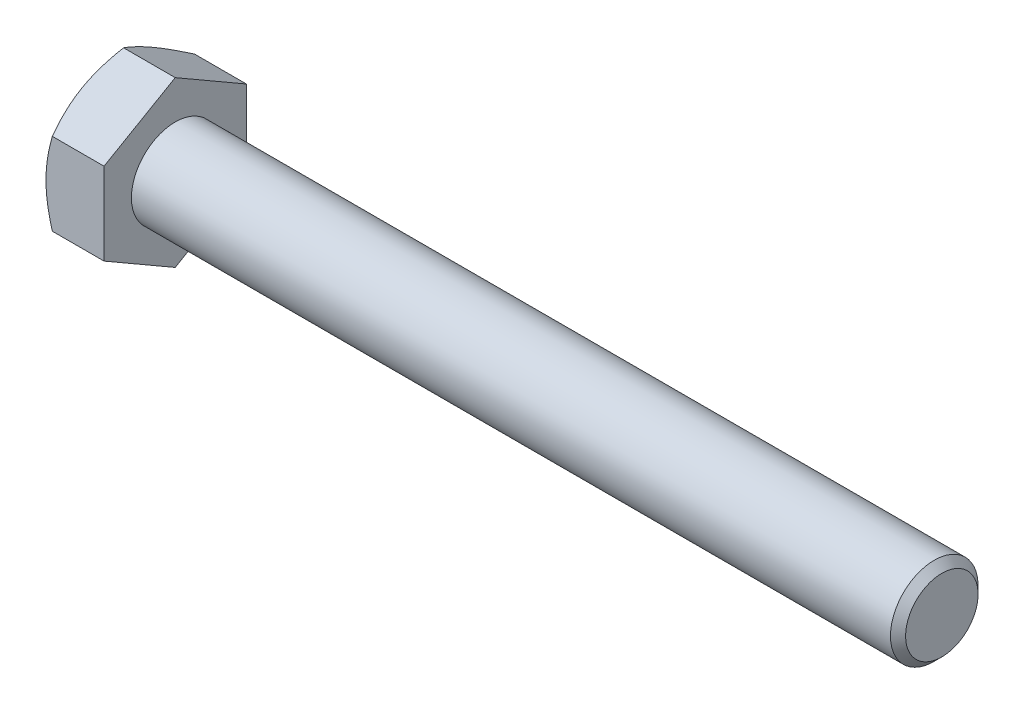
from build123d import *

# Parameters (mm, degrees)
BASEHEAD_DEPTH = 5.3


with BuildPart() as part:
    # Sketch1 → BaseHead (new body)
    with BuildSketch(Plane(origin=(0, 0, 0), x_dir=(0, 0, -1), z_dir=(1, 0, 0))):
        Polygon((6.5, 3.75277675), (6.5, -3.75277675), (0, -7.505553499), (-6.5, -3.75277675), (-6.5, 3.75277675), (0, 7.505553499), align=None)
    extrude(amount=BASEHEAD_DEPTH)

    # BodySke → BaseBody (revolve)
    with BuildSketch(Plane.XY, mode=Mode.PRIVATE) as basebody_sk:
        Polygon((0, 0), (75.3, 0), (75.3, 3.3095), (74.6095, 4), (0, 4), align=None)
    revolve(basebody_sk.sketch.rotate(Axis((0, 0, 0), (1, 0, 0)), 90), axis=Axis((0, 0, 0), (1, 0, 0)))

    # Sketch3 → HeadChamfer (revolve, cut)
    with BuildSketch(Plane.XY):
        Polygon((0, 6.5), (3.46730793, 12.505553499), (3.46730793, 17.505553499), (-10, 17.505553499), (-10, 6.5), align=None)
    revolve(axis=Axis((0, 0, 0), (1, 0, 0)), mode=Mode.SUBTRACT)


solid = part.part
